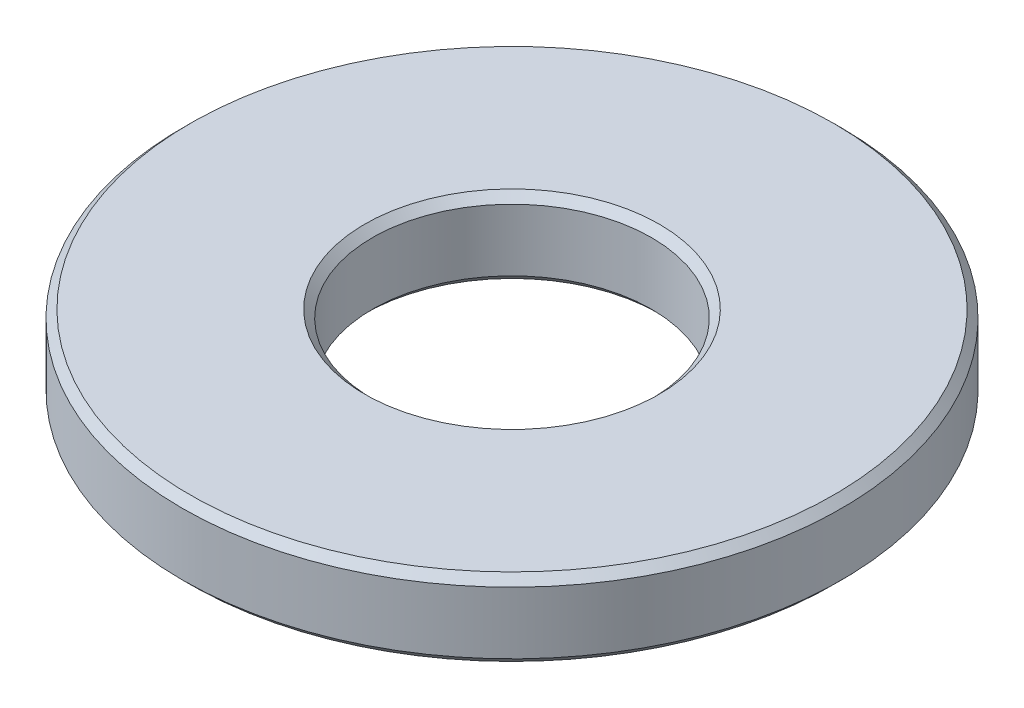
ISO-10303-21;
HEADER;
FILE_DESCRIPTION(('STEP AP214'),'2;1');
FILE_NAME('part.step','',(''),(''),'','','');
FILE_SCHEMA(('AUTOMOTIVE_DESIGN { 1 0 10303 214 1 1 1 1 }'));
ENDSEC;
DATA;
#1=APPLICATION_CONTEXT('core data for automotive mechanical design processes');
#2=APPLICATION_PROTOCOL_DEFINITION('international standard','automotive_design',2000,#1);
#3=PRODUCT_CONTEXT('',#1,'mechanical');
#4=PRODUCT('Part','Part','',(#3));
#5=PRODUCT_RELATED_PRODUCT_CATEGORY('part','',(#4));
#6=PRODUCT_DEFINITION_FORMATION('','',#4);
#7=PRODUCT_DEFINITION_CONTEXT('part definition',#1,'design');
#8=PRODUCT_DEFINITION('design','',#6,#7);
#9=PRODUCT_DEFINITION_SHAPE('','',#8);
#10=(LENGTH_UNIT() NAMED_UNIT(*) SI_UNIT(.MILLI.,.METRE.));
#11=(NAMED_UNIT(*) PLANE_ANGLE_UNIT() SI_UNIT($,.RADIAN.));
#12=(NAMED_UNIT(*) SI_UNIT($,.STERADIAN.) SOLID_ANGLE_UNIT());
#13=UNCERTAINTY_MEASURE_WITH_UNIT(LENGTH_MEASURE(1.E-05),#10,'distance_accuracy_value','');
#14=(GEOMETRIC_REPRESENTATION_CONTEXT(3) GLOBAL_UNCERTAINTY_ASSIGNED_CONTEXT((#13)) GLOBAL_UNIT_ASSIGNED_CONTEXT((#10,
#11,#12)) REPRESENTATION_CONTEXT('',''));
#15=CARTESIAN_POINT('',(0.,0.,0.));
#16=DIRECTION('',(0.,0.,1.));
#17=DIRECTION('',(1.,0.,0.));
#18=AXIS2_PLACEMENT_3D('',#15,#16,#17);
#19=CARTESIAN_POINT('',(0.,20.,0.));
#20=DIRECTION('',(0.,1.,0.));
#21=DIRECTION('',(0.,0.,1.));
#22=AXIS2_PLACEMENT_3D('',#19,#20,#21);
#23=CONICAL_SURFACE('',#22,38.,0.785398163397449);
#24=CARTESIAN_POINT('',(0.,18.,0.));
#25=DIRECTION('',(0.,-1.,0.));
#26=DIRECTION('',(0.,0.,-1.));
#27=AXIS2_PLACEMENT_3D('',#24,#25,#26);
#28=CIRCLE('',#27,36.);
#29=CARTESIAN_POINT('',(0.,18.,-36.));
#30=VERTEX_POINT('',#29);
#31=EDGE_CURVE('E67',#30,#30,#28,.T.);
#32=ORIENTED_EDGE('',*,*,#31,.T.);
#33=EDGE_LOOP('',(#32));
#34=FACE_BOUND('',#33,.T.);
#35=CARTESIAN_POINT('',(0.,20.,0.));
#36=DIRECTION('',(0.,-1.,0.));
#37=DIRECTION('',(0.,0.,-1.));
#38=AXIS2_PLACEMENT_3D('',#35,#36,#37);
#39=CIRCLE('',#38,38.);
#40=CARTESIAN_POINT('',(0.,20.,-38.));
#41=VERTEX_POINT('',#40);
#42=EDGE_CURVE('E10',#41,#41,#39,.T.);
#43=ORIENTED_EDGE('',*,*,#42,.F.);
#44=EDGE_LOOP('',(#43));
#45=FACE_BOUND('',#44,.T.);
#46=ADVANCED_FACE('F39',(#34,#45),#23,.F.);
#47=CARTESIAN_POINT('',(38.,20.,0.));
#48=DIRECTION('',(0.,1.,0.));
#49=DIRECTION('',(0.,0.,1.));
#50=AXIS2_PLACEMENT_3D('',#47,#48,#49);
#51=PLANE('',#50);
#52=ORIENTED_EDGE('',*,*,#42,.T.);
#53=EDGE_LOOP('',(#52));
#54=FACE_BOUND('',#53,.T.);
#55=CARTESIAN_POINT('',(0.,20.,0.));
#56=DIRECTION('',(0.,-1.,0.));
#57=DIRECTION('',(0.,0.,-1.));
#58=AXIS2_PLACEMENT_3D('',#55,#56,#57);
#59=CIRCLE('',#58,83.);
#60=CARTESIAN_POINT('',(0.,20.,-83.));
#61=VERTEX_POINT('',#60);
#62=EDGE_CURVE('E45',#61,#61,#59,.T.);
#63=ORIENTED_EDGE('',*,*,#62,.F.);
#64=EDGE_LOOP('',(#63));
#65=FACE_BOUND('',#64,.T.);
#66=ADVANCED_FACE('F85',(#54,#65),#51,.T.);
#67=CARTESIAN_POINT('',(0.,18.,0.));
#68=DIRECTION('',(0.,-1.,0.));
#69=DIRECTION('',(0.,0.,-1.));
#70=AXIS2_PLACEMENT_3D('',#67,#68,#69);
#71=CONICAL_SURFACE('',#70,85.,0.785398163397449);
#72=ORIENTED_EDGE('',*,*,#62,.T.);
#73=EDGE_LOOP('',(#72));
#74=FACE_BOUND('',#73,.T.);
#75=CARTESIAN_POINT('',(0.,18.,0.));
#76=DIRECTION('',(0.,-1.,0.));
#77=DIRECTION('',(0.,0.,-1.));
#78=AXIS2_PLACEMENT_3D('',#75,#76,#77);
#79=CIRCLE('',#78,85.);
#80=CARTESIAN_POINT('',(0.,18.,-85.));
#81=VERTEX_POINT('',#80);
#82=EDGE_CURVE('E49',#81,#81,#79,.T.);
#83=ORIENTED_EDGE('',*,*,#82,.F.);
#84=EDGE_LOOP('',(#83));
#85=FACE_BOUND('',#84,.T.);
#86=ADVANCED_FACE('F89',(#74,#85),#71,.T.);
#87=CARTESIAN_POINT('',(0.,0.,0.));
#88=DIRECTION('',(0.,-1.,0.));
#89=DIRECTION('',(0.,0.,-1.));
#90=AXIS2_PLACEMENT_3D('',#87,#88,#89);
#91=CYLINDRICAL_SURFACE('',#90,85.);
#92=ORIENTED_EDGE('',*,*,#82,.T.);
#93=EDGE_LOOP('',(#92));
#94=FACE_BOUND('',#93,.T.);
#95=CARTESIAN_POINT('',(0.,2.,0.));
#96=DIRECTION('',(0.,-1.,0.));
#97=DIRECTION('',(0.,0.,-1.));
#98=AXIS2_PLACEMENT_3D('',#95,#96,#97);
#99=CIRCLE('',#98,85.);
#100=CARTESIAN_POINT('',(0.,2.,-85.));
#101=VERTEX_POINT('',#100);
#102=EDGE_CURVE('E53',#101,#101,#99,.T.);
#103=ORIENTED_EDGE('',*,*,#102,.F.);
#104=EDGE_LOOP('',(#103));
#105=FACE_BOUND('',#104,.T.);
#106=ADVANCED_FACE('F93',(#94,#105),#91,.T.);
#107=CARTESIAN_POINT('',(0.,0.,0.));
#108=DIRECTION('',(0.,1.,0.));
#109=DIRECTION('',(0.,0.,1.));
#110=AXIS2_PLACEMENT_3D('',#107,#108,#109);
#111=CONICAL_SURFACE('',#110,83.,0.785398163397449);
#112=ORIENTED_EDGE('',*,*,#102,.T.);
#113=EDGE_LOOP('',(#112));
#114=FACE_BOUND('',#113,.T.);
#115=CARTESIAN_POINT('',(0.,0.,0.));
#116=DIRECTION('',(0.,-1.,0.));
#117=DIRECTION('',(0.,0.,-1.));
#118=AXIS2_PLACEMENT_3D('',#115,#116,#117);
#119=CIRCLE('',#118,83.);
#120=CARTESIAN_POINT('',(0.,0.,-83.));
#121=VERTEX_POINT('',#120);
#122=EDGE_CURVE('E58',#121,#121,#119,.T.);
#123=ORIENTED_EDGE('',*,*,#122,.F.);
#124=EDGE_LOOP('',(#123));
#125=FACE_BOUND('',#124,.T.);
#126=ADVANCED_FACE('F99',(#114,#125),#111,.T.);
#127=CARTESIAN_POINT('',(83.,0.,0.));
#128=DIRECTION('',(0.,-1.,0.));
#129=DIRECTION('',(0.,0.,-1.));
#130=AXIS2_PLACEMENT_3D('',#127,#128,#129);
#131=PLANE('',#130);
#132=ORIENTED_EDGE('',*,*,#122,.T.);
#133=EDGE_LOOP('',(#132));
#134=FACE_BOUND('',#133,.T.);
#135=CARTESIAN_POINT('',(0.,0.,0.));
#136=DIRECTION('',(0.,-1.,0.));
#137=DIRECTION('',(0.,0.,-1.));
#138=AXIS2_PLACEMENT_3D('',#135,#136,#137);
#139=CIRCLE('',#138,38.);
#140=CARTESIAN_POINT('',(0.,0.,-38.));
#141=VERTEX_POINT('',#140);
#142=EDGE_CURVE('E61',#141,#141,#139,.T.);
#143=ORIENTED_EDGE('',*,*,#142,.F.);
#144=EDGE_LOOP('',(#143));
#145=FACE_BOUND('',#144,.T.);
#146=ADVANCED_FACE('F81',(#134,#145),#131,.T.);
#147=CARTESIAN_POINT('',(0.,1.99999999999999,0.));
#148=DIRECTION('',(0.,-1.,0.));
#149=DIRECTION('',(0.,0.,-1.));
#150=AXIS2_PLACEMENT_3D('',#147,#148,#149);
#151=CONICAL_SURFACE('',#150,36.,0.785398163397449);
#152=ORIENTED_EDGE('',*,*,#142,.T.);
#153=EDGE_LOOP('',(#152));
#154=FACE_BOUND('',#153,.T.);
#155=CARTESIAN_POINT('',(0.,1.99999999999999,0.));
#156=DIRECTION('',(0.,-1.,0.));
#157=DIRECTION('',(0.,0.,-1.));
#158=AXIS2_PLACEMENT_3D('',#155,#156,#157);
#159=CIRCLE('',#158,36.);
#160=CARTESIAN_POINT('',(0.,1.99999999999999,-36.));
#161=VERTEX_POINT('',#160);
#162=EDGE_CURVE('E64',#161,#161,#159,.T.);
#163=ORIENTED_EDGE('',*,*,#162,.F.);
#164=EDGE_LOOP('',(#163));
#165=FACE_BOUND('',#164,.T.);
#166=ADVANCED_FACE('F75',(#154,#165),#151,.F.);
#167=CARTESIAN_POINT('',(0.,0.,0.));
#168=DIRECTION('',(0.,-1.,0.));
#169=DIRECTION('',(0.,0.,-1.));
#170=AXIS2_PLACEMENT_3D('',#167,#168,#169);
#171=CYLINDRICAL_SURFACE('',#170,36.);
#172=ORIENTED_EDGE('',*,*,#162,.T.);
#173=EDGE_LOOP('',(#172));
#174=FACE_BOUND('',#173,.T.);
#175=ORIENTED_EDGE('',*,*,#31,.F.);
#176=EDGE_LOOP('',(#175));
#177=FACE_BOUND('',#176,.T.);
#178=ADVANCED_FACE('F73',(#174,#177),#171,.F.);
#179=CLOSED_SHELL('',(#46,#66,#86,#106,#126,#146,#166,#178));
#180=MANIFOLD_SOLID_BREP('B2',#179);
#181=ADVANCED_BREP_SHAPE_REPRESENTATION('',(#18,#180),#14);
#182=SHAPE_DEFINITION_REPRESENTATION(#9,#181);
ENDSEC;
END-ISO-10303-21;
